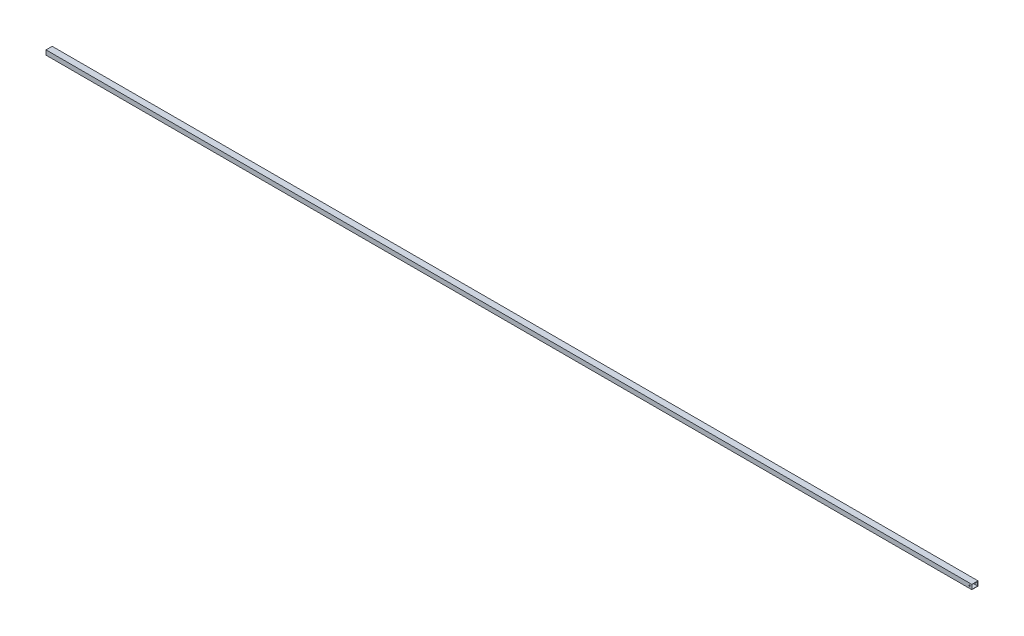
ISO-10303-21;
HEADER;
FILE_DESCRIPTION(('STEP AP214'),'2;1');
FILE_NAME('part.step','',(''),(''),'','','');
FILE_SCHEMA(('AUTOMOTIVE_DESIGN { 1 0 10303 214 1 1 1 1 }'));
ENDSEC;
DATA;
#1=APPLICATION_CONTEXT('core data for automotive mechanical design processes');
#2=APPLICATION_PROTOCOL_DEFINITION('international standard','automotive_design',2000,#1);
#3=PRODUCT_CONTEXT('',#1,'mechanical');
#4=PRODUCT('Part','Part','',(#3));
#5=PRODUCT_RELATED_PRODUCT_CATEGORY('part','',(#4));
#6=PRODUCT_DEFINITION_FORMATION('','',#4);
#7=PRODUCT_DEFINITION_CONTEXT('part definition',#1,'design');
#8=PRODUCT_DEFINITION('design','',#6,#7);
#9=PRODUCT_DEFINITION_SHAPE('','',#8);
#10=(LENGTH_UNIT() NAMED_UNIT(*) SI_UNIT(.MILLI.,.METRE.));
#11=(NAMED_UNIT(*) PLANE_ANGLE_UNIT() SI_UNIT($,.RADIAN.));
#12=(NAMED_UNIT(*) SI_UNIT($,.STERADIAN.) SOLID_ANGLE_UNIT());
#13=UNCERTAINTY_MEASURE_WITH_UNIT(LENGTH_MEASURE(1.E-05),#10,'distance_accuracy_value','');
#14=(GEOMETRIC_REPRESENTATION_CONTEXT(3) GLOBAL_UNCERTAINTY_ASSIGNED_CONTEXT((#13)) GLOBAL_UNIT_ASSIGNED_CONTEXT((#10,
#11,#12)) REPRESENTATION_CONTEXT('',''));
#15=CARTESIAN_POINT('',(0.,0.,0.));
#16=DIRECTION('',(0.,0.,1.));
#17=DIRECTION('',(1.,0.,0.));
#18=AXIS2_PLACEMENT_3D('',#15,#16,#17);
#19=CARTESIAN_POINT('',(-6000.,0.,0.));
#20=DIRECTION('',(0.,0.,1.));
#21=DIRECTION('',(1.,0.,0.));
#22=AXIS2_PLACEMENT_3D('',#19,#20,#21);
#23=PLANE('',#22);
#24=CARTESIAN_POINT('',(-15.,15.,0.));
#25=DIRECTION('',(0.,0.,1.));
#26=DIRECTION('',(1.,0.,0.));
#27=AXIS2_PLACEMENT_3D('',#24,#25,#26);
#28=CIRCLE('',#27,4.);
#29=CARTESIAN_POINT('',(-11.,15.,0.));
#30=VERTEX_POINT('',#29);
#31=EDGE_CURVE('E204',#30,#30,#28,.T.);
#32=ORIENTED_EDGE('',*,*,#31,.F.);
#33=EDGE_LOOP('',(#32));
#34=FACE_BOUND('',#33,.T.);
#35=DIRECTION('',(0.,-1.,0.));
#36=VECTOR('',#35,1.);
#37=CARTESIAN_POINT('',(0.,0.,0.));
#38=LINE('',#37,#36);
#39=CARTESIAN_POINT('',(0.,30.,0.));
#40=VERTEX_POINT('',#39);
#41=CARTESIAN_POINT('',(0.,0.,0.));
#42=VERTEX_POINT('',#41);
#43=EDGE_CURVE('E140',#40,#42,#38,.T.);
#44=ORIENTED_EDGE('',*,*,#43,.F.);
#45=DIRECTION('',(1.,0.,0.));
#46=VECTOR('',#45,1.);
#47=CARTESIAN_POINT('',(-6000.,30.,0.));
#48=LINE('',#47,#46);
#49=CARTESIAN_POINT('',(-6000.,30.,0.));
#50=VERTEX_POINT('',#49);
#51=EDGE_CURVE('E11',#50,#40,#48,.T.);
#52=ORIENTED_EDGE('',*,*,#51,.F.);
#53=DIRECTION('',(0.,-1.,0.));
#54=VECTOR('',#53,1.);
#55=CARTESIAN_POINT('',(-6000.,0.,0.));
#56=LINE('',#55,#54);
#57=CARTESIAN_POINT('',(-6000.,0.,0.));
#58=VERTEX_POINT('',#57);
#59=EDGE_CURVE('E144',#50,#58,#56,.T.);
#60=ORIENTED_EDGE('',*,*,#59,.T.);
#61=DIRECTION('',(1.,0.,0.));
#62=VECTOR('',#61,1.);
#63=CARTESIAN_POINT('',(-6000.,0.,0.));
#64=LINE('',#63,#62);
#65=EDGE_CURVE('E157',#58,#42,#64,.T.);
#66=ORIENTED_EDGE('',*,*,#65,.T.);
#67=EDGE_LOOP('',(#44,#52,#60,#66));
#68=FACE_BOUND('',#67,.T.);
#69=ADVANCED_FACE('F39',(#34,#68),#23,.T.);
#70=CARTESIAN_POINT('',(-6000.,30.,0.));
#71=DIRECTION('',(0.,1.,0.));
#72=DIRECTION('',(0.,0.,1.));
#73=AXIS2_PLACEMENT_3D('',#70,#71,#72);
#74=PLANE('',#73);
#75=DIRECTION('',(0.,0.,1.));
#76=VECTOR('',#75,1.);
#77=CARTESIAN_POINT('',(0.,30.,0.));
#78=LINE('',#77,#76);
#79=CARTESIAN_POINT('',(0.,30.,-40.));
#80=VERTEX_POINT('',#79);
#81=EDGE_CURVE('E148',#80,#40,#78,.T.);
#82=ORIENTED_EDGE('',*,*,#81,.F.);
#83=DIRECTION('',(1.,0.,0.));
#84=VECTOR('',#83,1.);
#85=CARTESIAN_POINT('',(-6000.,30.,-40.));
#86=LINE('',#85,#84);
#87=CARTESIAN_POINT('',(-6000.,30.,-40.));
#88=VERTEX_POINT('',#87);
#89=EDGE_CURVE('E47',#88,#80,#86,.T.);
#90=ORIENTED_EDGE('',*,*,#89,.F.);
#91=DIRECTION('',(0.,0.,1.));
#92=VECTOR('',#91,1.);
#93=CARTESIAN_POINT('',(-6000.,30.,0.));
#94=LINE('',#93,#92);
#95=EDGE_CURVE('E154',#88,#50,#94,.T.);
#96=ORIENTED_EDGE('',*,*,#95,.T.);
#97=ORIENTED_EDGE('',*,*,#51,.T.);
#98=EDGE_LOOP('',(#82,#90,#96,#97));
#99=FACE_BOUND('',#98,.T.);
#100=ADVANCED_FACE('F182',(#99),#74,.T.);
#101=CARTESIAN_POINT('',(-6000.,0.,-40.));
#102=DIRECTION('',(0.,0.,-1.));
#103=DIRECTION('',(-1.,0.,0.));
#104=AXIS2_PLACEMENT_3D('',#101,#102,#103);
#105=PLANE('',#104);
#106=CARTESIAN_POINT('',(-15.,15.,-40.));
#107=DIRECTION('',(0.,0.,1.));
#108=DIRECTION('',(1.,0.,0.));
#109=AXIS2_PLACEMENT_3D('',#106,#107,#108);
#110=CIRCLE('',#109,4.);
#111=CARTESIAN_POINT('',(-11.,15.,-40.));
#112=VERTEX_POINT('',#111);
#113=EDGE_CURVE('E206',#112,#112,#110,.T.);
#114=ORIENTED_EDGE('',*,*,#113,.T.);
#115=EDGE_LOOP('',(#114));
#116=FACE_BOUND('',#115,.T.);
#117=DIRECTION('',(0.,1.,0.));
#118=VECTOR('',#117,1.);
#119=CARTESIAN_POINT('',(0.,0.,-40.));
#120=LINE('',#119,#118);
#121=CARTESIAN_POINT('',(0.,0.,-40.));
#122=VERTEX_POINT('',#121);
#123=EDGE_CURVE('E163',#122,#80,#120,.T.);
#124=ORIENTED_EDGE('',*,*,#123,.F.);
#125=DIRECTION('',(1.,0.,0.));
#126=VECTOR('',#125,1.);
#127=CARTESIAN_POINT('',(-6000.,0.,-40.));
#128=LINE('',#127,#126);
#129=CARTESIAN_POINT('',(-6000.,0.,-40.));
#130=VERTEX_POINT('',#129);
#131=EDGE_CURVE('E169',#130,#122,#128,.T.);
#132=ORIENTED_EDGE('',*,*,#131,.F.);
#133=DIRECTION('',(0.,1.,0.));
#134=VECTOR('',#133,1.);
#135=CARTESIAN_POINT('',(-6000.,0.,-40.));
#136=LINE('',#135,#134);
#137=EDGE_CURVE('E151',#130,#88,#136,.T.);
#138=ORIENTED_EDGE('',*,*,#137,.T.);
#139=ORIENTED_EDGE('',*,*,#89,.T.);
#140=EDGE_LOOP('',(#124,#132,#138,#139));
#141=FACE_BOUND('',#140,.T.);
#142=ADVANCED_FACE('F186',(#116,#141),#105,.T.);
#143=CARTESIAN_POINT('',(-6000.,0.,0.));
#144=DIRECTION('',(0.,-1.,0.));
#145=DIRECTION('',(0.,0.,-1.));
#146=AXIS2_PLACEMENT_3D('',#143,#144,#145);
#147=PLANE('',#146);
#148=DIRECTION('',(0.,0.,-1.));
#149=VECTOR('',#148,1.);
#150=CARTESIAN_POINT('',(0.,0.,0.));
#151=LINE('',#150,#149);
#152=EDGE_CURVE('E160',#42,#122,#151,.T.);
#153=ORIENTED_EDGE('',*,*,#152,.F.);
#154=ORIENTED_EDGE('',*,*,#65,.F.);
#155=DIRECTION('',(0.,0.,-1.));
#156=VECTOR('',#155,1.);
#157=CARTESIAN_POINT('',(-6000.,0.,0.));
#158=LINE('',#157,#156);
#159=EDGE_CURVE('E147',#58,#130,#158,.T.);
#160=ORIENTED_EDGE('',*,*,#159,.T.);
#161=ORIENTED_EDGE('',*,*,#131,.T.);
#162=EDGE_LOOP('',(#153,#154,#160,#161));
#163=FACE_BOUND('',#162,.T.);
#164=ADVANCED_FACE('F176',(#163),#147,.T.);
#165=CARTESIAN_POINT('',(-6000.,0.,0.));
#166=DIRECTION('',(-1.,0.,0.));
#167=DIRECTION('',(0.,0.,1.));
#168=AXIS2_PLACEMENT_3D('',#165,#166,#167);
#169=PLANE('',#168);
#170=DIRECTION('',(0.,-1.,0.));
#171=VECTOR('',#170,1.);
#172=CARTESIAN_POINT('',(-6000.,2.,-2.));
#173=LINE('',#172,#171);
#174=CARTESIAN_POINT('',(-6000.,28.,-2.));
#175=VERTEX_POINT('',#174);
#176=CARTESIAN_POINT('',(-6000.,2.,-2.));
#177=VERTEX_POINT('',#176);
#178=EDGE_CURVE('E106',#175,#177,#173,.T.);
#179=ORIENTED_EDGE('',*,*,#178,.T.);
#180=DIRECTION('',(0.,0.,-1.));
#181=VECTOR('',#180,1.);
#182=CARTESIAN_POINT('',(-6000.,2.,-2.));
#183=LINE('',#182,#181);
#184=CARTESIAN_POINT('',(-6000.,2.,-38.));
#185=VERTEX_POINT('',#184);
#186=EDGE_CURVE('E115',#177,#185,#183,.T.);
#187=ORIENTED_EDGE('',*,*,#186,.T.);
#188=DIRECTION('',(0.,1.,0.));
#189=VECTOR('',#188,1.);
#190=CARTESIAN_POINT('',(-6000.,2.,-38.));
#191=LINE('',#190,#189);
#192=CARTESIAN_POINT('',(-6000.,28.,-38.));
#193=VERTEX_POINT('',#192);
#194=EDGE_CURVE('E55',#185,#193,#191,.T.);
#195=ORIENTED_EDGE('',*,*,#194,.T.);
#196=DIRECTION('',(0.,0.,1.));
#197=VECTOR('',#196,1.);
#198=CARTESIAN_POINT('',(-6000.,28.,-2.));
#199=LINE('',#198,#197);
#200=EDGE_CURVE('E112',#193,#175,#199,.T.);
#201=ORIENTED_EDGE('',*,*,#200,.T.);
#202=EDGE_LOOP('',(#179,#187,#195,#201));
#203=FACE_BOUND('',#202,.T.);
#204=ORIENTED_EDGE('',*,*,#59,.F.);
#205=ORIENTED_EDGE('',*,*,#95,.F.);
#206=ORIENTED_EDGE('',*,*,#137,.F.);
#207=ORIENTED_EDGE('',*,*,#159,.F.);
#208=EDGE_LOOP('',(#204,#205,#206,#207));
#209=FACE_BOUND('',#208,.T.);
#210=ADVANCED_FACE('F119',(#203,#209),#169,.T.);
#211=CARTESIAN_POINT('',(0.,0.,0.));
#212=DIRECTION('',(-1.,0.,0.));
#213=DIRECTION('',(0.,0.,1.));
#214=AXIS2_PLACEMENT_3D('',#211,#212,#213);
#215=PLANE('',#214);
#216=DIRECTION('',(0.,0.,-1.));
#217=VECTOR('',#216,1.);
#218=CARTESIAN_POINT('',(0.,2.,-2.));
#219=LINE('',#218,#217);
#220=CARTESIAN_POINT('',(0.,2.,-2.));
#221=VERTEX_POINT('',#220);
#222=CARTESIAN_POINT('',(0.,2.,-38.));
#223=VERTEX_POINT('',#222);
#224=EDGE_CURVE('E134',#221,#223,#219,.T.);
#225=ORIENTED_EDGE('',*,*,#224,.F.);
#226=DIRECTION('',(0.,-1.,0.));
#227=VECTOR('',#226,1.);
#228=CARTESIAN_POINT('',(0.,2.,-2.));
#229=LINE('',#228,#227);
#230=CARTESIAN_POINT('',(0.,28.,-2.));
#231=VERTEX_POINT('',#230);
#232=EDGE_CURVE('E63',#231,#221,#229,.T.);
#233=ORIENTED_EDGE('',*,*,#232,.F.);
#234=DIRECTION('',(0.,0.,1.));
#235=VECTOR('',#234,1.);
#236=CARTESIAN_POINT('',(0.,28.,-2.));
#237=LINE('',#236,#235);
#238=CARTESIAN_POINT('',(0.,28.,-38.));
#239=VERTEX_POINT('',#238);
#240=EDGE_CURVE('E122',#239,#231,#237,.T.);
#241=ORIENTED_EDGE('',*,*,#240,.F.);
#242=DIRECTION('',(0.,1.,0.));
#243=VECTOR('',#242,1.);
#244=CARTESIAN_POINT('',(0.,2.,-38.));
#245=LINE('',#244,#243);
#246=EDGE_CURVE('E125',#223,#239,#245,.T.);
#247=ORIENTED_EDGE('',*,*,#246,.F.);
#248=EDGE_LOOP('',(#225,#233,#241,#247));
#249=FACE_BOUND('',#248,.T.);
#250=ORIENTED_EDGE('',*,*,#43,.T.);
#251=ORIENTED_EDGE('',*,*,#152,.T.);
#252=ORIENTED_EDGE('',*,*,#123,.T.);
#253=ORIENTED_EDGE('',*,*,#81,.T.);
#254=EDGE_LOOP('',(#250,#251,#252,#253));
#255=FACE_BOUND('',#254,.T.);
#256=ADVANCED_FACE('F179',(#249,#255),#215,.F.);
#257=CARTESIAN_POINT('',(-6000.,2.,-2.));
#258=DIRECTION('',(0.,0.,1.));
#259=DIRECTION('',(1.,0.,0.));
#260=AXIS2_PLACEMENT_3D('',#257,#258,#259);
#261=PLANE('',#260);
#262=CARTESIAN_POINT('',(-15.,15.,-2.));
#263=DIRECTION('',(0.,0.,1.));
#264=DIRECTION('',(1.,0.,0.));
#265=AXIS2_PLACEMENT_3D('',#262,#263,#264);
#266=CIRCLE('',#265,4.);
#267=CARTESIAN_POINT('',(-11.,15.,-2.));
#268=VERTEX_POINT('',#267);
#269=EDGE_CURVE('E128',#268,#268,#266,.T.);
#270=ORIENTED_EDGE('',*,*,#269,.T.);
#271=EDGE_LOOP('',(#270));
#272=FACE_BOUND('',#271,.T.);
#273=ORIENTED_EDGE('',*,*,#232,.T.);
#274=DIRECTION('',(1.,0.,0.));
#275=VECTOR('',#274,1.);
#276=CARTESIAN_POINT('',(-6000.,2.,-2.));
#277=LINE('',#276,#275);
#278=EDGE_CURVE('E102',#177,#221,#277,.T.);
#279=ORIENTED_EDGE('',*,*,#278,.F.);
#280=ORIENTED_EDGE('',*,*,#178,.F.);
#281=DIRECTION('',(1.,0.,0.));
#282=VECTOR('',#281,1.);
#283=CARTESIAN_POINT('',(-6000.,28.,-2.));
#284=LINE('',#283,#282);
#285=EDGE_CURVE('E138',#175,#231,#284,.T.);
#286=ORIENTED_EDGE('',*,*,#285,.T.);
#287=EDGE_LOOP('',(#273,#279,#280,#286));
#288=FACE_BOUND('',#287,.T.);
#289=ADVANCED_FACE('F104',(#272,#288),#261,.F.);
#290=CARTESIAN_POINT('',(-6000.,28.,-2.));
#291=DIRECTION('',(0.,1.,0.));
#292=DIRECTION('',(0.,0.,1.));
#293=AXIS2_PLACEMENT_3D('',#290,#291,#292);
#294=PLANE('',#293);
#295=ORIENTED_EDGE('',*,*,#240,.T.);
#296=ORIENTED_EDGE('',*,*,#285,.F.);
#297=ORIENTED_EDGE('',*,*,#200,.F.);
#298=DIRECTION('',(1.,0.,0.));
#299=VECTOR('',#298,1.);
#300=CARTESIAN_POINT('',(-6000.,28.,-38.));
#301=LINE('',#300,#299);
#302=EDGE_CURVE('E141',#193,#239,#301,.T.);
#303=ORIENTED_EDGE('',*,*,#302,.T.);
#304=EDGE_LOOP('',(#295,#296,#297,#303));
#305=FACE_BOUND('',#304,.T.);
#306=ADVANCED_FACE('F225',(#305),#294,.F.);
#307=CARTESIAN_POINT('',(-6000.,2.,-38.));
#308=DIRECTION('',(0.,0.,-1.));
#309=DIRECTION('',(-1.,0.,0.));
#310=AXIS2_PLACEMENT_3D('',#307,#308,#309);
#311=PLANE('',#310);
#312=CARTESIAN_POINT('',(-15.,15.,-38.));
#313=DIRECTION('',(0.,0.,-1.));
#314=DIRECTION('',(-1.,0.,0.));
#315=AXIS2_PLACEMENT_3D('',#312,#313,#314);
#316=CIRCLE('',#315,4.);
#317=CARTESIAN_POINT('',(-19.,15.,-38.));
#318=VERTEX_POINT('',#317);
#319=EDGE_CURVE('E42',#318,#318,#316,.T.);
#320=ORIENTED_EDGE('',*,*,#319,.T.);
#321=EDGE_LOOP('',(#320));
#322=FACE_BOUND('',#321,.T.);
#323=ORIENTED_EDGE('',*,*,#246,.T.);
#324=ORIENTED_EDGE('',*,*,#302,.F.);
#325=ORIENTED_EDGE('',*,*,#194,.F.);
#326=DIRECTION('',(1.,0.,0.));
#327=VECTOR('',#326,1.);
#328=CARTESIAN_POINT('',(-6000.,2.,-38.));
#329=LINE('',#328,#327);
#330=EDGE_CURVE('E111',#185,#223,#329,.T.);
#331=ORIENTED_EDGE('',*,*,#330,.T.);
#332=EDGE_LOOP('',(#323,#324,#325,#331));
#333=FACE_BOUND('',#332,.T.);
#334=ADVANCED_FACE('F228',(#322,#333),#311,.F.);
#335=CARTESIAN_POINT('',(-6000.,2.,-2.));
#336=DIRECTION('',(0.,-1.,0.));
#337=DIRECTION('',(0.,0.,-1.));
#338=AXIS2_PLACEMENT_3D('',#335,#336,#337);
#339=PLANE('',#338);
#340=ORIENTED_EDGE('',*,*,#224,.T.);
#341=ORIENTED_EDGE('',*,*,#330,.F.);
#342=ORIENTED_EDGE('',*,*,#186,.F.);
#343=ORIENTED_EDGE('',*,*,#278,.T.);
#344=EDGE_LOOP('',(#340,#341,#342,#343));
#345=FACE_BOUND('',#344,.T.);
#346=ADVANCED_FACE('F116',(#345),#339,.F.);
#347=CARTESIAN_POINT('',(-15.,15.,-40.));
#348=DIRECTION('',(0.,0.,1.));
#349=DIRECTION('',(1.,0.,0.));
#350=AXIS2_PLACEMENT_3D('',#347,#348,#349);
#351=CYLINDRICAL_SURFACE('',#350,4.);
#352=ORIENTED_EDGE('',*,*,#113,.F.);
#353=EDGE_LOOP('',(#352));
#354=FACE_BOUND('',#353,.T.);
#355=ORIENTED_EDGE('',*,*,#319,.F.);
#356=EDGE_LOOP('',(#355));
#357=FACE_BOUND('',#356,.T.);
#358=ADVANCED_FACE('F218',(#354,#357),#351,.F.);
#359=ORIENTED_EDGE('',*,*,#31,.T.);
#360=EDGE_LOOP('',(#359));
#361=FACE_BOUND('',#360,.T.);
#362=ORIENTED_EDGE('',*,*,#269,.F.);
#363=EDGE_LOOP('',(#362));
#364=FACE_BOUND('',#363,.T.);
#365=ADVANCED_FACE('F216',(#361,#364),#351,.F.);
#366=CLOSED_SHELL('',(#69,#100,#142,#164,#210,#256,#289,#306,#334,#346,#358,#365));
#367=MANIFOLD_SOLID_BREP('B2',#366);
#368=ADVANCED_BREP_SHAPE_REPRESENTATION('',(#18,#367),#14);
#369=SHAPE_DEFINITION_REPRESENTATION(#9,#368);
ENDSEC;
END-ISO-10303-21;
